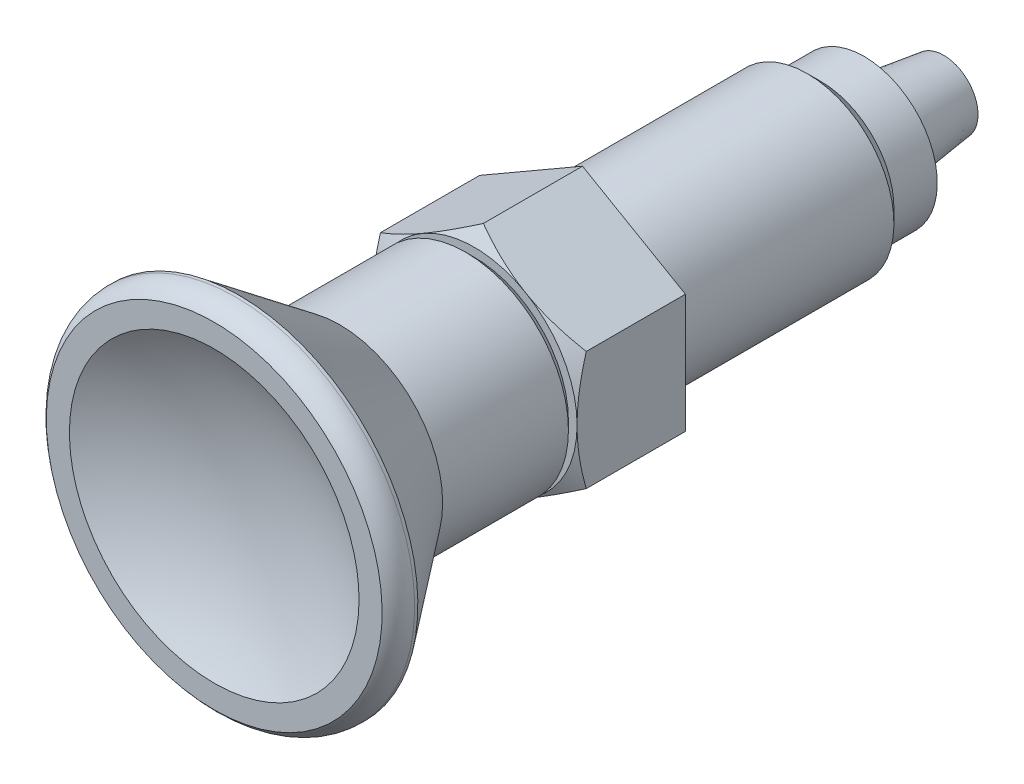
ISO-10303-21;
HEADER;
FILE_DESCRIPTION(('STEP AP214'),'2;1');
FILE_NAME('part.step','',(''),(''),'','','');
FILE_SCHEMA(('AUTOMOTIVE_DESIGN { 1 0 10303 214 1 1 1 1 }'));
ENDSEC;
DATA;
#1=APPLICATION_CONTEXT('core data for automotive mechanical design processes');
#2=APPLICATION_PROTOCOL_DEFINITION('international standard','automotive_design',2000,#1);
#3=PRODUCT_CONTEXT('',#1,'mechanical');
#4=PRODUCT('Part','Part','',(#3));
#5=PRODUCT_RELATED_PRODUCT_CATEGORY('part','',(#4));
#6=PRODUCT_DEFINITION_FORMATION('','',#4);
#7=PRODUCT_DEFINITION_CONTEXT('part definition',#1,'design');
#8=PRODUCT_DEFINITION('design','',#6,#7);
#9=PRODUCT_DEFINITION_SHAPE('','',#8);
#10=(LENGTH_UNIT() NAMED_UNIT(*) SI_UNIT(.MILLI.,.METRE.));
#11=(NAMED_UNIT(*) PLANE_ANGLE_UNIT() SI_UNIT($,.RADIAN.));
#12=(NAMED_UNIT(*) SI_UNIT($,.STERADIAN.) SOLID_ANGLE_UNIT());
#13=UNCERTAINTY_MEASURE_WITH_UNIT(LENGTH_MEASURE(1.E-05),#10,'distance_accuracy_value','');
#14=(GEOMETRIC_REPRESENTATION_CONTEXT(3) GLOBAL_UNCERTAINTY_ASSIGNED_CONTEXT((#13)) GLOBAL_UNIT_ASSIGNED_CONTEXT((#10,
#11,#12)) REPRESENTATION_CONTEXT('',''));
#15=CARTESIAN_POINT('',(0.,0.,0.));
#16=DIRECTION('',(0.,0.,1.));
#17=DIRECTION('',(1.,0.,0.));
#18=AXIS2_PLACEMENT_3D('',#15,#16,#17);
#19=CARTESIAN_POINT('',(0.,0.,-26.));
#20=DIRECTION('',(1.,0.,0.));
#21=DIRECTION('',(0.,-1.,0.));
#22=AXIS2_PLACEMENT_3D('',#19,#20,#21);
#23=SPHERICAL_SURFACE('',#22,8.);
#24=CARTESIAN_POINT('',(0.,0.,-33.3475882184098));
#25=DIRECTION('',(0.,0.,1.));
#26=DIRECTION('',(0.,1.,0.));
#27=AXIS2_PLACEMENT_3D('',#24,#25,#26);
#28=CIRCLE('',#27,3.16432415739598);
#29=CARTESIAN_POINT('',(0.,3.16432415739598,-33.3475882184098));
#30=VERTEX_POINT('',#29);
#31=EDGE_CURVE('E18',#30,#30,#28,.T.);
#32=ORIENTED_EDGE('',*,*,#31,.F.);
#33=EDGE_LOOP('',(#32));
#34=FACE_BOUND('',#33,.T.);
#35=ADVANCED_FACE('F14',(#34),#23,.T.);
#36=CARTESIAN_POINT('',(0.,0.,-26.9999999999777));
#37=DIRECTION('',(0.,0.,1.));
#38=DIRECTION('',(0.,1.,0.));
#39=AXIS2_PLACEMENT_3D('',#36,#37,#38);
#40=CONICAL_SURFACE('',#39,4.00000000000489,0.130899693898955);
#41=CARTESIAN_POINT('',(0.,0.,-27.));
#42=DIRECTION('',(0.,0.,1.));
#43=DIRECTION('',(0.,1.,0.));
#44=AXIS2_PLACEMENT_3D('',#41,#42,#43);
#45=CIRCLE('',#44,4.);
#46=CARTESIAN_POINT('',(0.,4.,-27.));
#47=VERTEX_POINT('',#46);
#48=EDGE_CURVE('E287',#47,#47,#45,.T.);
#49=ORIENTED_EDGE('',*,*,#48,.F.);
#50=EDGE_LOOP('',(#49));
#51=FACE_BOUND('',#50,.T.);
#52=ORIENTED_EDGE('',*,*,#31,.T.);
#53=EDGE_LOOP('',(#52));
#54=FACE_BOUND('',#53,.T.);
#55=ADVANCED_FACE('F614',(#51,#54),#40,.T.);
#56=CARTESIAN_POINT('',(0.,0.,-34.));
#57=DIRECTION('',(0.,0.,1.));
#58=DIRECTION('',(0.,1.,0.));
#59=AXIS2_PLACEMENT_3D('',#56,#57,#58);
#60=CYLINDRICAL_SURFACE('',#59,4.);
#61=CARTESIAN_POINT('',(0.,0.,-26.3732050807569));
#62=DIRECTION('',(0.,0.,-1.));
#63=DIRECTION('',(0.,-1.,0.));
#64=AXIS2_PLACEMENT_3D('',#61,#62,#63);
#65=CIRCLE('',#64,4.);
#66=CARTESIAN_POINT('',(0.,-4.,-26.3732050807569));
#67=VERTEX_POINT('',#66);
#68=EDGE_CURVE('E283',#67,#67,#65,.T.);
#69=ORIENTED_EDGE('',*,*,#68,.T.);
#70=EDGE_LOOP('',(#69));
#71=FACE_BOUND('',#70,.T.);
#72=ORIENTED_EDGE('',*,*,#48,.T.);
#73=EDGE_LOOP('',(#72));
#74=FACE_BOUND('',#73,.T.);
#75=ADVANCED_FACE('F606',(#71,#74),#60,.T.);
#76=CARTESIAN_POINT('',(0.,0.,-26.2));
#77=DIRECTION('',(0.,0.,-1.));
#78=DIRECTION('',(0.,-1.,0.));
#79=AXIS2_PLACEMENT_3D('',#76,#77,#78);
#80=TOROIDAL_SURFACE('',#79,4.1,0.2);
#81=CARTESIAN_POINT('',(0.,0.,-26.));
#82=DIRECTION('',(0.,0.,-1.));
#83=DIRECTION('',(0.,-1.,0.));
#84=AXIS2_PLACEMENT_3D('',#81,#82,#83);
#85=CIRCLE('',#84,4.1);
#86=CARTESIAN_POINT('',(0.,-4.1,-26.));
#87=VERTEX_POINT('',#86);
#88=EDGE_CURVE('E286',#87,#87,#85,.T.);
#89=ORIENTED_EDGE('',*,*,#88,.T.);
#90=EDGE_LOOP('',(#89));
#91=FACE_BOUND('',#90,.T.);
#92=ORIENTED_EDGE('',*,*,#68,.F.);
#93=EDGE_LOOP('',(#92));
#94=FACE_BOUND('',#93,.T.);
#95=ADVANCED_FACE('F265',(#91,#94),#80,.F.);
#96=CARTESIAN_POINT('',(-5.2,0.,-26.));
#97=DIRECTION('',(0.,0.,1.));
#98=DIRECTION('',(0.,1.,0.));
#99=AXIS2_PLACEMENT_3D('',#96,#97,#98);
#100=PLANE('',#99);
#101=CARTESIAN_POINT('',(0.,0.,-26.0000000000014));
#102=DIRECTION('',(0.,0.,1.));
#103=DIRECTION('',(0.,1.,0.));
#104=AXIS2_PLACEMENT_3D('',#101,#102,#103);
#105=CIRCLE('',#104,5.19999999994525);
#106=CARTESIAN_POINT('',(0.,5.19999999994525,-26.0000000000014));
#107=VERTEX_POINT('',#106);
#108=EDGE_CURVE('E414',#107,#107,#105,.T.);
#109=ORIENTED_EDGE('',*,*,#108,.F.);
#110=EDGE_LOOP('',(#109));
#111=FACE_BOUND('',#110,.T.);
#112=ORIENTED_EDGE('',*,*,#88,.F.);
#113=EDGE_LOOP('',(#112));
#114=FACE_BOUND('',#113,.T.);
#115=ADVANCED_FACE('F260',(#111,#114),#100,.F.);
#116=CARTESIAN_POINT('',(0.,0.,-25.7000000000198));
#117=DIRECTION('',(0.,0.,1.));
#118=DIRECTION('',(0.,1.,0.));
#119=AXIS2_PLACEMENT_3D('',#116,#117,#118);
#120=CONICAL_SURFACE('',#119,5.49999999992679,0.785398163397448);
#121=CARTESIAN_POINT('',(0.,0.,-25.7));
#122=DIRECTION('',(0.,0.,1.));
#123=DIRECTION('',(0.,1.,0.));
#124=AXIS2_PLACEMENT_3D('',#121,#122,#123);
#125=CIRCLE('',#124,5.5);
#126=CARTESIAN_POINT('',(0.,5.5,-25.7));
#127=VERTEX_POINT('',#126);
#128=EDGE_CURVE('E411',#127,#127,#125,.F.);
#129=ORIENTED_EDGE('',*,*,#128,.T.);
#130=EDGE_LOOP('',(#129));
#131=FACE_BOUND('',#130,.T.);
#132=ORIENTED_EDGE('',*,*,#108,.T.);
#133=EDGE_LOOP('',(#132));
#134=FACE_BOUND('',#133,.T.);
#135=ADVANCED_FACE('F256',(#131,#134),#120,.T.);
#136=CARTESIAN_POINT('',(0.,0.,-26.));
#137=DIRECTION('',(0.,0.,1.));
#138=DIRECTION('',(0.,1.,0.));
#139=AXIS2_PLACEMENT_3D('',#136,#137,#138);
#140=CYLINDRICAL_SURFACE('',#139,5.5);
#141=ORIENTED_EDGE('',*,*,#128,.F.);
#142=EDGE_LOOP('',(#141));
#143=FACE_BOUND('',#142,.T.);
#144=CARTESIAN_POINT('',(0.,0.,-26.));
#145=DIRECTION('',(0.,0.,1.));
#146=DIRECTION('',(0.,1.,0.));
#147=AXIS2_PLACEMENT_3D('',#144,#145,#146);
#148=CIRCLE('',#147,5.5);
#149=CARTESIAN_POINT('',(0.,5.5,-26.));
#150=VERTEX_POINT('',#149);
#151=EDGE_CURVE('E413',#150,#150,#148,.T.);
#152=ORIENTED_EDGE('',*,*,#151,.F.);
#153=EDGE_LOOP('',(#152));
#154=FACE_BOUND('',#153,.T.);
#155=ADVANCED_FACE('F252',(#143,#154),#140,.F.);
#156=CARTESIAN_POINT('',(-5.5,0.,-26.));
#157=DIRECTION('',(0.,0.,-1.));
#158=DIRECTION('',(0.,-1.,0.));
#159=AXIS2_PLACEMENT_3D('',#156,#157,#158);
#160=PLANE('',#159);
#161=ORIENTED_EDGE('',*,*,#151,.T.);
#162=EDGE_LOOP('',(#161));
#163=FACE_BOUND('',#162,.T.);
#164=CARTESIAN_POINT('',(0.,0.,-26.));
#165=DIRECTION('',(0.,0.,1.));
#166=DIRECTION('',(0.,1.,0.));
#167=AXIS2_PLACEMENT_3D('',#164,#165,#166);
#168=CIRCLE('',#167,6.75);
#169=CARTESIAN_POINT('',(0.,6.75,-26.));
#170=VERTEX_POINT('',#169);
#171=EDGE_CURVE('E408',#170,#170,#168,.T.);
#172=ORIENTED_EDGE('',*,*,#171,.F.);
#173=EDGE_LOOP('',(#172));
#174=FACE_BOUND('',#173,.T.);
#175=ADVANCED_FACE('F243',(#163,#174),#160,.T.);
#176=CARTESIAN_POINT('',(0.,0.,-26.));
#177=DIRECTION('',(0.,0.,1.));
#178=DIRECTION('',(0.,1.,0.));
#179=AXIS2_PLACEMENT_3D('',#176,#177,#178);
#180=CYLINDRICAL_SURFACE('',#179,6.75);
#181=ORIENTED_EDGE('',*,*,#171,.T.);
#182=EDGE_LOOP('',(#181));
#183=FACE_BOUND('',#182,.T.);
#184=CARTESIAN_POINT('',(0.,0.,-21.9999999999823));
#185=DIRECTION('',(0.,0.,1.));
#186=DIRECTION('',(0.,1.,0.));
#187=AXIS2_PLACEMENT_3D('',#184,#185,#186);
#188=CIRCLE('',#187,6.74999999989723);
#189=CARTESIAN_POINT('',(0.,6.74999999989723,-21.9999999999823));
#190=VERTEX_POINT('',#189);
#191=EDGE_CURVE('E404',#190,#190,#188,.T.);
#192=ORIENTED_EDGE('',*,*,#191,.F.);
#193=EDGE_LOOP('',(#192));
#194=FACE_BOUND('',#193,.T.);
#195=ADVANCED_FACE('F233',(#183,#194),#180,.T.);
#196=CARTESIAN_POINT('',(0.,0.,-20.7500000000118));
#197=DIRECTION('',(0.,0.,1.));
#198=DIRECTION('',(1.,0.,0.));
#199=AXIS2_PLACEMENT_3D('',#196,#197,#198);
#200=CONICAL_SURFACE('',#199,7.99999999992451,0.785398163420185);
#201=ORIENTED_EDGE('',*,*,#191,.T.);
#202=EDGE_LOOP('',(#201));
#203=FACE_BOUND('',#202,.T.);
#204=CARTESIAN_POINT('',(0.,0.,-20.75));
#205=DIRECTION('',(0.,0.,1.));
#206=DIRECTION('',(0.,1.,0.));
#207=AXIS2_PLACEMENT_3D('',#204,#205,#206);
#208=CIRCLE('',#207,8.);
#209=CARTESIAN_POINT('',(0.,8.,-20.75));
#210=VERTEX_POINT('',#209);
#211=EDGE_CURVE('E401',#210,#210,#208,.T.);
#212=ORIENTED_EDGE('',*,*,#211,.F.);
#213=EDGE_LOOP('',(#212));
#214=FACE_BOUND('',#213,.T.);
#215=ADVANCED_FACE('F230',(#203,#214),#200,.T.);
#216=CARTESIAN_POINT('',(0.,0.,56.3));
#217=DIRECTION('',(1.,0.,0.));
#218=DIRECTION('',(0.,-1.,0.));
#219=AXIS2_PLACEMENT_3D('',#216,#217,#218);
#220=SPHERICAL_SURFACE('',#219,26.);
#221=CARTESIAN_POINT('',(0.,-13.3682459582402,34.));
#222=CARTESIAN_POINT('',(0.375585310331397,-13.3682486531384,34.));
#223=CARTESIAN_POINT('',(0.751126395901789,-13.3524111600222,34.));
#224=CARTESIAN_POINT('',(1.49966463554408,-13.2891717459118,34.));
#225=CARTESIAN_POINT('',(1.87266109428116,-13.2417615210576,34.));
#226=CARTESIAN_POINT('',(2.61372997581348,-13.1156339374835,34.));
#227=CARTESIAN_POINT('',(2.98179666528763,-13.0368829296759,34.));
#228=CARTESIAN_POINT('',(3.70998226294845,-12.848636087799,34.));
#229=CARTESIAN_POINT('',(4.07010119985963,-12.7391403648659,34.));
#230=CARTESIAN_POINT('',(4.77965529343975,-12.4902434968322,34.));
#231=CARTESIAN_POINT('',(5.12909553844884,-12.3508568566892,34.));
#232=CARTESIAN_POINT('',(5.81499557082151,-12.0431356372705,34.));
#233=CARTESIAN_POINT('',(6.15145515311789,-11.8748006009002,34.));
#234=CARTESIAN_POINT('',(6.80891126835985,-11.5104276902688,34.));
#235=CARTESIAN_POINT('',(7.12991172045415,-11.314396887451,34.));
#236=CARTESIAN_POINT('',(7.75425858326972,-10.8959942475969,34.));
#237=CARTESIAN_POINT('',(8.05760506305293,-10.673622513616,34.));
#238=CARTESIAN_POINT('',(8.64452045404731,-10.2040929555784,34.));
#239=CARTESIAN_POINT('',(8.92808725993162,-9.95693249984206,34.));
#240=CARTESIAN_POINT('',(9.47339223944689,-9.43960204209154,34.));
#241=CARTESIAN_POINT('',(9.7351303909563,-9.16943201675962,34.));
#242=CARTESIAN_POINT('',(10.2349267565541,-8.60799236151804,34.));
#243=CARTESIAN_POINT('',(10.472984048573,-8.31672191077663,34.));
#244=CARTESIAN_POINT('',(10.9237145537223,-7.7151616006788,34.));
#245=CARTESIAN_POINT('',(11.1363877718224,-7.40487174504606,34.));
#246=CARTESIAN_POINT('',(11.5348344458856,-6.76748455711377,34.));
#247=CARTESIAN_POINT('',(11.7206084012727,-6.44038753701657,34.));
#248=CARTESIAN_POINT('',(12.063940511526,-5.77170618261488,34.));
#249=CARTESIAN_POINT('',(12.2214986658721,-5.43012184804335,34.));
#250=CARTESIAN_POINT('',(12.5072787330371,-4.73489504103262,34.));
#251=CARTESIAN_POINT('',(12.6355007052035,-4.38125259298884,34.));
#252=CARTESIAN_POINT('',(12.8616972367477,-3.66442308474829,34.));
#253=CARTESIAN_POINT('',(12.9596717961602,-3.30123602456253,34.));
#254=CARTESIAN_POINT('',(13.1246771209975,-2.56789862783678,34.));
#255=CARTESIAN_POINT('',(13.1917078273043,-2.19774827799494,34.));
#256=CARTESIAN_POINT('',(13.2943486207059,-1.45311652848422,34.));
#257=CARTESIAN_POINT('',(13.3299587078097,-1.07863512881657,34.));
#258=CARTESIAN_POINT('',(13.3695050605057,-0.328004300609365,34.));
#259=CARTESIAN_POINT('',(13.373441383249,0.0481451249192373,34.));
#260=CARTESIAN_POINT('',(13.3496123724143,0.799438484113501,34.));
#261=CARTESIAN_POINT('',(13.3218470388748,1.17458241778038,34.));
#262=CARTESIAN_POINT('',(13.2348120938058,1.92119788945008,34.));
#263=CARTESIAN_POINT('',(13.1755424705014,2.29266942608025,34.));
#264=CARTESIAN_POINT('',(13.0259203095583,3.02929902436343,34.));
#265=CARTESIAN_POINT('',(12.9355677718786,3.39445708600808,34.));
#266=CARTESIAN_POINT('',(12.7244220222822,4.11586406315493,34.));
#267=CARTESIAN_POINT('',(12.6036287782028,4.47211296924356,34.));
#268=CARTESIAN_POINT('',(12.3324604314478,5.17316851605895,34.));
#269=CARTESIAN_POINT('',(12.182085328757,5.51797515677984,34.));
#270=CARTESIAN_POINT('',(11.8528223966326,6.19369469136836,34.));
#271=CARTESIAN_POINT('',(11.6739345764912,6.5246075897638,34.));
#272=CARTESIAN_POINT('',(11.2889179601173,7.17018716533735,34.));
#273=CARTESIAN_POINT('',(11.0827891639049,7.48485384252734,34.));
#274=CARTESIAN_POINT('',(10.644756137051,8.09570375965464,34.));
#275=CARTESIAN_POINT('',(10.4128519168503,8.39188700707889,34.));
#276=CARTESIAN_POINT('',(9.92491667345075,8.96366451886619,34.));
#277=CARTESIAN_POINT('',(9.66888565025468,9.23925878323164,34.));
#278=CARTESIAN_POINT('',(9.13451699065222,9.76789905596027,34.));
#279=CARTESIAN_POINT('',(8.85617935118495,10.0209450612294,34.));
#280=CARTESIAN_POINT('',(8.2791763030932,10.5026897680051,34.));
#281=CARTESIAN_POINT('',(7.98051089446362,10.7313884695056,34.));
#282=CARTESIAN_POINT('',(7.36497559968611,11.1628126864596,34.));
#283=CARTESIAN_POINT('',(7.04810571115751,11.3655381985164,34.));
#284=CARTESIAN_POINT('',(6.39841424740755,11.7435747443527,34.));
#285=CARTESIAN_POINT('',(6.06559267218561,11.9188857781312,34.));
#286=CARTESIAN_POINT('',(5.38636401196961,12.2408470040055,34.));
#287=CARTESIAN_POINT('',(5.03995692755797,12.3874971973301,34.));
#288=CARTESIAN_POINT('',(4.33601998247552,12.6510941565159,34.));
#289=CARTESIAN_POINT('',(3.9784901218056,12.7680409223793,34.));
#290=CARTESIAN_POINT('',(3.25484946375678,12.9713996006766,34.));
#291=CARTESIAN_POINT('',(2.8887386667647,13.0578115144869,34.));
#292=CARTESIAN_POINT('',(2.15053894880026,13.1994861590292,34.));
#293=CARTESIAN_POINT('',(1.77845002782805,13.2547488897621,34.));
#294=CARTESIAN_POINT('',(1.03093939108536,13.3337322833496,34.));
#295=CARTESIAN_POINT('',(0.655517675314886,13.3574529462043,34.));
#296=CARTESIAN_POINT('',(-0.09598952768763,13.3731835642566,34.));
#297=CARTESIAN_POINT('',(-0.472075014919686,13.3651935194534,34.));
#298=CARTESIAN_POINT('',(-1.22223603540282,13.3175595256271,34.));
#299=CARTESIAN_POINT('',(-1.5963115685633,13.277915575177,34.));
#300=CARTESIAN_POINT('',(-2.33979321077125,13.1672556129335,34.));
#301=CARTESIAN_POINT('',(-2.70919931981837,13.0962396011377,34.));
#302=CARTESIAN_POINT('',(-3.44071587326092,12.9233403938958,34.));
#303=CARTESIAN_POINT('',(-3.80282631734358,12.8214571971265,34.));
#304=CARTESIAN_POINT('',(-4.51717713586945,12.5875479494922,34.));
#305=CARTESIAN_POINT('',(-4.86941751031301,12.4555218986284,34.));
#306=CARTESIAN_POINT('',(-5.56152392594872,12.1622655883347,34.));
#307=CARTESIAN_POINT('',(-5.90138996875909,12.001035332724,34.));
#308=CARTESIAN_POINT('',(-6.56633152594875,11.6505168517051,34.));
#309=CARTESIAN_POINT('',(-6.89140704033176,11.461228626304,34.));
#310=CARTESIAN_POINT('',(-7.52445640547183,11.0559399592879,34.));
#311=CARTESIAN_POINT('',(-7.83243025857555,10.8399395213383,34.));
#312=CARTESIAN_POINT('',(-8.42908684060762,10.3827620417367,34.));
#313=CARTESIAN_POINT('',(-8.71776956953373,10.1415850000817,34.));
#314=CARTESIAN_POINT('',(-9.27379165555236,9.63576883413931,34.));
#315=CARTESIAN_POINT('',(-9.54113100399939,9.37112970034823,34.));
#316=CARTESIAN_POINT('',(-10.0525655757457,8.82027085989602,34.));
#317=CARTESIAN_POINT('',(-10.296660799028,8.53405115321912,34.));
#318=CARTESIAN_POINT('',(-10.7598718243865,7.9420659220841,34.));
#319=CARTESIAN_POINT('',(-10.9789876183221,7.63630039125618,34.));
#320=CARTESIAN_POINT('',(-11.3906819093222,7.0073974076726,34.));
#321=CARTESIAN_POINT('',(-11.5832604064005,6.68425995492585,34.));
#322=CARTESIAN_POINT('',(-11.9405107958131,6.02291079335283,34.));
#323=CARTESIAN_POINT('',(-12.1051827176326,5.68469910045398,34.));
#324=CARTESIAN_POINT('',(-12.405449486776,4.9956056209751,34.));
#325=CARTESIAN_POINT('',(-12.5410443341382,4.64472383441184,34.));
#326=CARTESIAN_POINT('',(-12.782192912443,3.93278485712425,34.));
#327=CARTESIAN_POINT('',(-12.8877466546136,3.5717276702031,34.));
#328=CARTESIAN_POINT('',(-13.0680626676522,2.84200466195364,34.));
#329=CARTESIAN_POINT('',(-13.1428249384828,2.4733388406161,34.));
#330=CARTESIAN_POINT('',(-13.2610266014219,1.73101888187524,34.));
#331=CARTESIAN_POINT('',(-13.3044659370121,1.35736473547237,34.));
#332=CARTESIAN_POINT('',(-13.3597126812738,0.607725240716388,34.));
#333=CARTESIAN_POINT('',(-13.3715200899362,0.231739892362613,34.));
#334=CARTESIAN_POINT('',(-13.3634190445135,-0.519888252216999,34.));
#335=CARTESIAN_POINT('',(-13.3435106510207,-0.895531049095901,34.));
#336=CARTESIAN_POINT('',(-13.2721196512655,-1.64380422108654,34.));
#337=CARTESIAN_POINT('',(-13.2206370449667,-2.01643459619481,34.));
#338=CARTESIAN_POINT('',(-13.0864634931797,-2.75603450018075,34.));
#339=CARTESIAN_POINT('',(-13.0037724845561,-3.12300401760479,34.));
#340=CARTESIAN_POINT('',(-12.8077700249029,-3.84867248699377,34.));
#341=CARTESIAN_POINT('',(-12.6944585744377,-4.20737143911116,34.));
#342=CARTESIAN_POINT('',(-12.4380184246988,-4.91395521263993,34.));
#343=CARTESIAN_POINT('',(-12.2948891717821,-5.261839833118,34.));
#344=CARTESIAN_POINT('',(-11.9798322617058,-5.94431469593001,34.));
#345=CARTESIAN_POINT('',(-11.8079045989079,-6.27890493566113,34.));
#346=CARTESIAN_POINT('',(-11.4364804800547,-6.93239940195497,34.));
#347=CARTESIAN_POINT('',(-11.2369850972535,-7.25130423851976,34.));
#348=CARTESIAN_POINT('',(-10.8118388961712,-7.87117441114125,34.));
#349=CARTESIAN_POINT('',(-10.5861881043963,-8.17213976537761,34.));
#350=CARTESIAN_POINT('',(-10.110360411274,-8.75396077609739,34.));
#351=CARTESIAN_POINT('',(-9.86018611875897,-9.03481856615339,34.));
#352=CARTESIAN_POINT('',(-9.33706848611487,-9.57446448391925,34.));
#353=CARTESIAN_POINT('',(-9.06412505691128,-9.83325252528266,34.));
#354=CARTESIAN_POINT('',(-8.49733759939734,-10.3269813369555,34.));
#355=CARTESIAN_POINT('',(-8.20348826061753,-10.5619160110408,34.));
#356=CARTESIAN_POINT('',(-7.59704532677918,-11.0061886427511,34.));
#357=CARTESIAN_POINT('',(-7.28445202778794,-11.2155270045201,34.));
#358=CARTESIAN_POINT('',(-6.64258363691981,-11.6072177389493,34.));
#359=CARTESIAN_POINT('',(-6.31330053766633,-11.7895569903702,34.));
#360=CARTESIAN_POINT('',(-5.64053678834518,-12.1258308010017,34.));
#361=CARTESIAN_POINT('',(-5.2970560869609,-12.2797652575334,34.));
#362=CARTESIAN_POINT('',(-4.59871120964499,-12.5579840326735,34.));
#363=CARTESIAN_POINT('',(-4.24385967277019,-12.682300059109,34.));
#364=CARTESIAN_POINT('',(-3.52506734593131,-12.9005804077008,34.));
#365=CARTESIAN_POINT('',(-3.16112897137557,-12.99455270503,34.));
#366=CARTESIAN_POINT('',(-2.33514245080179,-13.1710678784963,34.));
#367=CARTESIAN_POINT('',(-1.87121744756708,-13.2449469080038,34.));
#368=CARTESIAN_POINT('',(-0.938171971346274,-13.3435342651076,34.));
#369=CARTESIAN_POINT('',(-0.46905149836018,-13.3682425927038,34.));
#370=CARTESIAN_POINT('',(0.,-13.3682459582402,34.));
#371=B_SPLINE_CURVE_WITH_KNOTS('',3,(#221,#222,#223,#224,#225,#226,#227,#228,#229,#230,#231,
#232,#233,#234,#235,#236,#237,#238,#239,#240,#241,#242,#243,#244,#245,#246,#247,#248,#249,#250,
#251,#252,#253,#254,#255,#256,#257,#258,#259,#260,#261,#262,#263,#264,#265,#266,#267,#268,#269,
#270,#271,#272,#273,#274,#275,#276,#277,#278,#279,#280,#281,#282,#283,#284,#285,#286,#287,#288,
#289,#290,#291,#292,#293,#294,#295,#296,#297,#298,#299,#300,#301,#302,#303,#304,#305,#306,#307,
#308,#309,#310,#311,#312,#313,#314,#315,#316,#317,#318,#319,#320,#321,#322,#323,#324,#325,#326,
#327,#328,#329,#330,#331,#332,#333,#334,#335,#336,#337,#338,#339,#340,#341,#342,#343,#344,#345,
#346,#347,#348,#349,#350,#351,#352,#353,#354,#355,#356,#357,#358,#359,#360,#361,#362,#363,#364,
#365,#366,#367,#368,#369,#370),.UNSPECIFIED.,.T.,.F.,(4,2,2,2,2,2,2,2,2,2,2,2,2,2,2,2,2,2,2,2,2,
2,2,2,2,2,2,2,2,2,2,2,2,2,2,2,2,2,2,2,2,2,2,2,2,2,2,2,2,2,2,2,2,2,2,2,2,2,2,2,2,2,2,2,2,2,2,2,2,
2,2,2,2,2,4),(0.,1.12634621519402,2.25298878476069,3.38084425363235,4.50869564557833,
5.63600096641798,6.76332408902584,7.89035989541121,9.01739129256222,10.1445424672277,
11.2716947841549,12.3988909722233,13.5260869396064,14.6532619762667,15.7804370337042,
16.907609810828,18.0347825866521,19.1619575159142,20.2891324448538,21.4163053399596,
22.5434782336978,23.6706515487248,24.7978248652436,25.9249993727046,27.0521738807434,
28.1793480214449,29.3065221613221,30.4336958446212,31.5608695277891,32.6880433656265,
33.8152172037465,34.9423911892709,36.0695651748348,37.1967391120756,38.3239130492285,
39.4510869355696,40.5782608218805,41.7054347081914,42.8326085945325,43.9597825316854,
45.0869564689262,46.2141304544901,47.3413044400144,48.4684782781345,49.5956521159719,
50.7228257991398,51.8499994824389,52.9771736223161,54.1043477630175,55.2315222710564,
56.3586967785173,57.4858700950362,58.6130434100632,59.7402163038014,60.8673891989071,
61.9945641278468,63.1217390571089,64.248911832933,65.3760846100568,66.5032596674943,
67.6304347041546,68.7576306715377,69.8848268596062,71.0119791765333,72.1391303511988,
73.2661617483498,74.3931975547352,75.520520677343,76.6478259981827,77.7756773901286,
78.9035328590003,80.030175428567,81.156521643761,82.5631644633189,83.9698072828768),.UNSPECIFIED.);
#372=CARTESIAN_POINT('',(0.,-13.3682459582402,34.));
#373=VERTEX_POINT('',#372);
#374=EDGE_CURVE('E313',#373,#373,#371,.T.);
#375=ORIENTED_EDGE('',*,*,#374,.T.);
#376=EDGE_LOOP('',(#375));
#377=FACE_BOUND('',#376,.T.);
#378=ADVANCED_FACE('F232',(#377),#220,.F.);
#379=CARTESIAN_POINT('',(-13.36824595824,0.,34.));
#380=DIRECTION('',(0.,0.,-1.));
#381=DIRECTION('',(0.,-1.,0.));
#382=AXIS2_PLACEMENT_3D('',#379,#380,#381);
#383=PLANE('',#382);
#384=ORIENTED_EDGE('',*,*,#374,.F.);
#385=EDGE_LOOP('',(#384));
#386=FACE_BOUND('',#385,.T.);
#387=CARTESIAN_POINT('',(0.,0.,34.));
#388=DIRECTION('',(0.,0.,-1.));
#389=DIRECTION('',(0.,-1.,0.));
#390=AXIS2_PLACEMENT_3D('',#387,#388,#389);
#391=CIRCLE('',#390,15.5);
#392=CARTESIAN_POINT('',(0.,-15.5,34.));
#393=VERTEX_POINT('',#392);
#394=EDGE_CURVE('E306',#393,#393,#391,.T.);
#395=ORIENTED_EDGE('',*,*,#394,.F.);
#396=EDGE_LOOP('',(#395));
#397=FACE_BOUND('',#396,.T.);
#398=ADVANCED_FACE('F241',(#386,#397),#383,.F.);
#399=CARTESIAN_POINT('',(0.,0.,32.));
#400=DIRECTION('',(0.,0.,-1.));
#401=DIRECTION('',(0.,-1.,0.));
#402=AXIS2_PLACEMENT_3D('',#399,#400,#401);
#403=TOROIDAL_SURFACE('',#402,14.,2.5);
#404=CARTESIAN_POINT('',(0.,0.,32.));
#405=DIRECTION('',(0.,0.,1.));
#406=DIRECTION('',(0.,1.,0.));
#407=AXIS2_PLACEMENT_3D('',#404,#405,#406);
#408=CIRCLE('',#407,16.5);
#409=CARTESIAN_POINT('',(0.,16.5,32.));
#410=VERTEX_POINT('',#409);
#411=EDGE_CURVE('E664',#410,#410,#408,.F.);
#412=ORIENTED_EDGE('',*,*,#411,.F.);
#413=EDGE_LOOP('',(#412));
#414=FACE_BOUND('',#413,.T.);
#415=ORIENTED_EDGE('',*,*,#394,.T.);
#416=EDGE_LOOP('',(#415));
#417=FACE_BOUND('',#416,.T.);
#418=ADVANCED_FACE('F327',(#414,#417),#403,.T.);
#419=CARTESIAN_POINT('',(0.,0.,-34.));
#420=DIRECTION('',(0.,0.,1.));
#421=DIRECTION('',(0.,1.,0.));
#422=AXIS2_PLACEMENT_3D('',#419,#420,#421);
#423=CYLINDRICAL_SURFACE('',#422,16.5);
#424=ORIENTED_EDGE('',*,*,#411,.T.);
#425=EDGE_LOOP('',(#424));
#426=FACE_BOUND('',#425,.T.);
#427=CARTESIAN_POINT('',(0.,0.,31.7));
#428=DIRECTION('',(0.,0.,1.));
#429=DIRECTION('',(0.,1.,0.));
#430=AXIS2_PLACEMENT_3D('',#427,#428,#429);
#431=CIRCLE('',#430,16.5);
#432=CARTESIAN_POINT('',(0.,16.5,31.7));
#433=VERTEX_POINT('',#432);
#434=EDGE_CURVE('E9',#433,#433,#431,.F.);
#435=ORIENTED_EDGE('',*,*,#434,.F.);
#436=EDGE_LOOP('',(#435));
#437=FACE_BOUND('',#436,.T.);
#438=ADVANCED_FACE('F538',(#426,#437),#423,.T.);
#439=CARTESIAN_POINT('',(0.,0.,31.7));
#440=DIRECTION('',(0.,0.,1.));
#441=DIRECTION('',(1.,0.,0.));
#442=AXIS2_PLACEMENT_3D('',#439,#440,#441);
#443=CONICAL_SURFACE('',#442,16.5,0.645771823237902);
#444=ORIENTED_EDGE('',*,*,#434,.T.);
#445=EDGE_LOOP('',(#444));
#446=FACE_BOUND('',#445,.T.);
#447=CARTESIAN_POINT('',(0.,0.,22.4106862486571));
#448=DIRECTION('',(0.,0.,1.));
#449=DIRECTION('',(0.,1.,0.));
#450=AXIS2_PLACEMENT_3D('',#447,#448,#449);
#451=CIRCLE('',#450,9.5);
#452=CARTESIAN_POINT('',(0.,9.5,22.4106862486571));
#453=VERTEX_POINT('',#452);
#454=EDGE_CURVE('E24',#453,#453,#451,.T.);
#455=ORIENTED_EDGE('',*,*,#454,.T.);
#456=EDGE_LOOP('',(#455));
#457=FACE_BOUND('',#456,.T.);
#458=ADVANCED_FACE('F526',(#446,#457),#443,.T.);
#459=CARTESIAN_POINT('',(0.,0.,-34.));
#460=DIRECTION('',(0.,0.,1.));
#461=DIRECTION('',(0.,1.,0.));
#462=AXIS2_PLACEMENT_3D('',#459,#460,#461);
#463=CYLINDRICAL_SURFACE('',#462,9.5);
#464=ORIENTED_EDGE('',*,*,#454,.F.);
#465=EDGE_LOOP('',(#464));
#466=FACE_BOUND('',#465,.T.);
#467=CARTESIAN_POINT('',(0.,0.,10.8));
#468=DIRECTION('',(0.,0.,1.));
#469=DIRECTION('',(0.,1.,0.));
#470=AXIS2_PLACEMENT_3D('',#467,#468,#469);
#471=CIRCLE('',#470,9.5);
#472=CARTESIAN_POINT('',(0.,9.5,10.8));
#473=VERTEX_POINT('',#472);
#474=EDGE_CURVE('E309',#473,#473,#471,.T.);
#475=ORIENTED_EDGE('',*,*,#474,.T.);
#476=EDGE_LOOP('',(#475));
#477=FACE_BOUND('',#476,.T.);
#478=ADVANCED_FACE('F337',(#466,#477),#463,.T.);
#479=CARTESIAN_POINT('',(0.,0.,10.8));
#480=DIRECTION('',(0.,0.,1.));
#481=DIRECTION('',(1.,0.,0.));
#482=AXIS2_PLACEMENT_3D('',#479,#480,#481);
#483=CONICAL_SURFACE('',#482,9.5,0.785398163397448);
#484=ORIENTED_EDGE('',*,*,#474,.F.);
#485=EDGE_LOOP('',(#484));
#486=FACE_BOUND('',#485,.T.);
#487=CARTESIAN_POINT('',(0.,0.,10.));
#488=DIRECTION('',(0.,0.,1.));
#489=DIRECTION('',(1.,0.,0.));
#490=AXIS2_PLACEMENT_3D('',#487,#488,#489);
#491=CIRCLE('',#490,8.7);
#492=CARTESIAN_POINT('',(8.7,0.,10.));
#493=VERTEX_POINT('',#492);
#494=EDGE_CURVE('E310',#493,#493,#491,.T.);
#495=ORIENTED_EDGE('',*,*,#494,.T.);
#496=EDGE_LOOP('',(#495));
#497=FACE_BOUND('',#496,.T.);
#498=ADVANCED_FACE('F329',(#486,#497),#483,.T.);
#499=CARTESIAN_POINT('',(-9.5,0.,10.));
#500=DIRECTION('',(0.,0.,1.));
#501=DIRECTION('',(0.,1.,0.));
#502=AXIS2_PLACEMENT_3D('',#499,#500,#501);
#503=PLANE('',#502);
#504=CARTESIAN_POINT('',(0.,0.,10.));
#505=DIRECTION('',(0.,0.,-1.));
#506=DIRECTION('',(0.,-1.,0.));
#507=AXIS2_PLACEMENT_3D('',#504,#505,#506);
#508=CIRCLE('',#507,9.5);
#509=CARTESIAN_POINT('',(9.5,0.,10.));
#510=VERTEX_POINT('',#509);
#511=CARTESIAN_POINT('',(4.75,8.22724133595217,10.));
#512=VERTEX_POINT('',#511);
#513=EDGE_CURVE('E342',#510,#512,#508,.F.);
#514=ORIENTED_EDGE('',*,*,#513,.T.);
#515=CARTESIAN_POINT('',(0.,0.,10.));
#516=DIRECTION('',(0.,0.,-1.));
#517=DIRECTION('',(0.,-1.,0.));
#518=AXIS2_PLACEMENT_3D('',#515,#516,#517);
#519=CIRCLE('',#518,9.5);
#520=CARTESIAN_POINT('',(-4.75,8.22724133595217,10.));
#521=VERTEX_POINT('',#520);
#522=EDGE_CURVE('E90',#512,#521,#519,.F.);
#523=ORIENTED_EDGE('',*,*,#522,.T.);
#524=CARTESIAN_POINT('',(0.,0.,10.));
#525=DIRECTION('',(0.,0.,-1.));
#526=DIRECTION('',(0.,-1.,0.));
#527=AXIS2_PLACEMENT_3D('',#524,#525,#526);
#528=CIRCLE('',#527,9.5);
#529=CARTESIAN_POINT('',(-9.5,0.,10.));
#530=VERTEX_POINT('',#529);
#531=EDGE_CURVE('E87',#521,#530,#528,.F.);
#532=ORIENTED_EDGE('',*,*,#531,.T.);
#533=CARTESIAN_POINT('',(0.,0.,10.));
#534=DIRECTION('',(0.,0.,-1.));
#535=DIRECTION('',(0.,-1.,0.));
#536=AXIS2_PLACEMENT_3D('',#533,#534,#535);
#537=CIRCLE('',#536,9.5);
#538=CARTESIAN_POINT('',(-4.75,-8.22724133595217,10.));
#539=VERTEX_POINT('',#538);
#540=EDGE_CURVE('E355',#530,#539,#537,.F.);
#541=ORIENTED_EDGE('',*,*,#540,.T.);
#542=CARTESIAN_POINT('',(0.,0.,10.));
#543=DIRECTION('',(0.,0.,-1.));
#544=DIRECTION('',(0.,-1.,0.));
#545=AXIS2_PLACEMENT_3D('',#542,#543,#544);
#546=CIRCLE('',#545,9.5);
#547=CARTESIAN_POINT('',(4.75,-8.22724133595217,10.));
#548=VERTEX_POINT('',#547);
#549=EDGE_CURVE('E351',#539,#548,#546,.F.);
#550=ORIENTED_EDGE('',*,*,#549,.T.);
#551=CARTESIAN_POINT('',(0.,0.,10.));
#552=DIRECTION('',(0.,0.,-1.));
#553=DIRECTION('',(0.,-1.,0.));
#554=AXIS2_PLACEMENT_3D('',#551,#552,#553);
#555=CIRCLE('',#554,9.5);
#556=EDGE_CURVE('E348',#548,#510,#555,.F.);
#557=ORIENTED_EDGE('',*,*,#556,.T.);
#558=EDGE_LOOP('',(#514,#523,#532,#541,#550,#557));
#559=FACE_BOUND('',#558,.T.);
#560=ORIENTED_EDGE('',*,*,#494,.F.);
#561=EDGE_LOOP('',(#560));
#562=FACE_BOUND('',#561,.T.);
#563=ADVANCED_FACE('F229',(#559,#562),#503,.T.);
#564=CARTESIAN_POINT('',(0.,0.,9.14640318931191));
#565=DIRECTION('',(0.,0.,-1.));
#566=DIRECTION('',(0.,-1.,0.));
#567=AXIS2_PLACEMENT_3D('',#564,#565,#566);
#568=CONICAL_SURFACE('',#567,10.9784730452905,1.0471975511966);
#569=CARTESIAN_POINT('',(4.19480442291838E-08,10.969655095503,9.15149419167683));
#570=CARTESIAN_POINT('',(-0.386647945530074,10.7464238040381,9.28040919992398));
#571=CARTESIAN_POINT('',(-0.776392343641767,10.5214047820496,9.39851784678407));
#572=CARTESIAN_POINT('',(-1.55931669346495,10.069383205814,9.60680031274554));
#573=CARTESIAN_POINT('',(-1.95246933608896,9.84239641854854,9.69711226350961));
#574=CARTESIAN_POINT('',(-2.5459087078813,9.4997740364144,9.80800000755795));
#575=CARTESIAN_POINT('',(-2.74447147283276,9.38513377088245,9.84087935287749));
#576=CARTESIAN_POINT('',(-3.14254760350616,9.15530440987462,9.89779418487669));
#577=CARTESIAN_POINT('',(-3.34206094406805,9.04011532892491,9.92182990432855));
#578=CARTESIAN_POINT('',(-3.74277620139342,8.80876226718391,9.96063517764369));
#579=CARTESIAN_POINT('',(-3.94398156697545,8.69259629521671,9.97535760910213));
#580=CARTESIAN_POINT('',(-4.34678800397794,8.46003589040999,9.9950603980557));
#581=CARTESIAN_POINT('',(-4.54838914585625,8.34364141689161,10.0000388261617));
#582=CARTESIAN_POINT('',(-4.75,8.22724133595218,10.));
#583=B_SPLINE_CURVE_WITH_KNOTS('',3,(#569,#570,#571,#572,#573,#574,#575,#576,#577,#578,#579,
#580,#581,#582),.UNSPECIFIED.,.F.,.F.,(4,2,2,2,2,2,4),(0.,1.39466966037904,2.78229243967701,
3.47701425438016,4.1717177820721,4.86990876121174,5.56823797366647),.UNSPECIFIED.);
#584=CARTESIAN_POINT('',(1.44292469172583E-08,10.9696551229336,9.15149421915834));
#585=VERTEX_POINT('',#584);
#586=EDGE_CURVE('E82',#585,#521,#583,.T.);
#587=ORIENTED_EDGE('',*,*,#586,.T.);
#588=ORIENTED_EDGE('',*,*,#522,.F.);
#589=CARTESIAN_POINT('',(4.75,8.22724133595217,10.));
#590=CARTESIAN_POINT('',(4.54838915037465,8.34364141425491,10.0000388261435));
#591=CARTESIAN_POINT('',(4.34678801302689,8.46003588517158,9.99506039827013));
#592=CARTESIAN_POINT('',(3.9439815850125,8.692596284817,9.97535761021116));
#593=CARTESIAN_POINT('',(3.74277622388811,8.80876225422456,9.96063517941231));
#594=CARTESIAN_POINT('',(3.34206097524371,9.04011531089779,9.92182990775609));
#595=CARTESIAN_POINT('',(3.14254763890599,9.15530438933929,9.8977941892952));
#596=CARTESIAN_POINT('',(2.7444715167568,9.3851337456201,9.84087935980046));
#597=CARTESIAN_POINT('',(2.54590875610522,9.49977400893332,9.8080000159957));
#598=CARTESIAN_POINT('',(1.95246939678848,9.84239638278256,9.69711227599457));
#599=CARTESIAN_POINT('',(1.55931676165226,10.0693831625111,9.60680032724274));
#600=CARTESIAN_POINT('',(0.776392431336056,10.5214047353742,9.39851787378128));
#601=CARTESIAN_POINT('',(0.386648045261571,10.7464237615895,9.28040923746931));
#602=CARTESIAN_POINT('',(7.5030291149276E-08,10.9696550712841,9.1514942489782));
#603=B_SPLINE_CURVE_WITH_KNOTS('',3,(#589,#590,#591,#592,#593,#594,#595,#596,#597,#598,#599,
#600,#601,#602),.UNSPECIFIED.,.F.,.F.,(4,2,2,2,2,2,4),(0.,0.698329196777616,1.39652016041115,
2.09122367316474,2.78594547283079,4.1735682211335,5.56823784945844),.UNSPECIFIED.);
#604=EDGE_CURVE('E33',#512,#585,#603,.T.);
#605=ORIENTED_EDGE('',*,*,#604,.T.);
#606=EDGE_LOOP('',(#587,#588,#605));
#607=FACE_BOUND('',#606,.T.);
#608=ADVANCED_FACE('F89',(#607),#568,.T.);
#609=CARTESIAN_POINT('',(0.,0.,9.14640318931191));
#610=DIRECTION('',(0.,0.,-1.));
#611=DIRECTION('',(0.,-1.,0.));
#612=AXIS2_PLACEMENT_3D('',#609,#610,#611);
#613=CONICAL_SURFACE('',#612,10.9784730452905,1.0471975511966);
#614=CARTESIAN_POINT('',(-9.49999996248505,5.48482758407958,9.15149419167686));
#615=CARTESIAN_POINT('',(-9.49999998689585,5.03836495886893,9.28040919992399));
#616=CARTESIAN_POINT('',(-9.49999999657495,4.5883268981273,9.39851784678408));
#617=CARTESIAN_POINT('',(-9.50000000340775,3.68428373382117,9.60680031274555));
#618=CARTESIAN_POINT('',(-9.50000000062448,3.23031016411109,9.69711226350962));
#619=CARTESIAN_POINT('',(-9.49999999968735,2.54506540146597,9.80800000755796));
#620=CARTESIAN_POINT('',(-9.49999999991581,2.31578487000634,9.8408793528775));
#621=CARTESIAN_POINT('',(-9.50000000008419,1.85612614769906,9.8977941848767));
#622=CARTESIAN_POINT('',(-9.50000000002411,1.62574798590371,9.92182990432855));
#623=CARTESIAN_POINT('',(-9.49999999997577,1.16304186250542,9.96063517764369));
#624=CARTESIAN_POINT('',(-9.49999999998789,0.930709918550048,9.97535760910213));
#625=CARTESIAN_POINT('',(-9.50000000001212,0.465589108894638,9.99506039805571));
#626=CARTESIAN_POINT('',(-9.50000000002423,0.232800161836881,10.0000388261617));
#627=CARTESIAN_POINT('',(-9.5,0.,10.));
#628=B_SPLINE_CURVE_WITH_KNOTS('',3,(#614,#615,#616,#617,#618,#619,#620,#621,#622,#623,#624,
#625,#626,#627),.UNSPECIFIED.,.F.,.F.,(4,2,2,2,2,2,4),(0.,1.39466966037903,2.78229243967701,
3.47701425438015,4.1717177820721,4.86990876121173,5.56823797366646),.UNSPECIFIED.);
#629=CARTESIAN_POINT('',(-9.5,5.4848275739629,9.15149421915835));
#630=VERTEX_POINT('',#629);
#631=EDGE_CURVE('E205',#630,#530,#628,.T.);
#632=ORIENTED_EDGE('',*,*,#631,.T.);
#633=ORIENTED_EDGE('',*,*,#531,.F.);
#634=CARTESIAN_POINT('',(-4.75,8.22724133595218,10.));
#635=CARTESIAN_POINT('',(-4.95161084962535,8.11084125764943,10.0000388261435));
#636=CARTESIAN_POINT('',(-5.15321198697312,7.99444678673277,9.99506039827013));
#637=CARTESIAN_POINT('',(-5.55601841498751,7.76188638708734,9.97535761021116));
#638=CARTESIAN_POINT('',(-5.7572237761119,7.64572041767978,9.9606351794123));
#639=CARTESIAN_POINT('',(-6.15793902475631,7.41436736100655,9.92182990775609));
#640=CARTESIAN_POINT('',(-6.35745236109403,7.29917828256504,9.89779418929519));
#641=CARTESIAN_POINT('',(-6.75552848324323,7.06934892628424,9.84087935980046));
#642=CARTESIAN_POINT('',(-6.95409124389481,6.95470866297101,9.8080000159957));
#643=CARTESIAN_POINT('',(-7.54753060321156,6.61208628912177,9.69711227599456));
#644=CARTESIAN_POINT('',(-7.94068323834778,6.38509950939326,9.60680032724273));
#645=CARTESIAN_POINT('',(-8.72360756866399,5.93307793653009,9.39851787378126));
#646=CARTESIAN_POINT('',(-9.11335195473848,5.70805891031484,9.28040923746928));
#647=CARTESIAN_POINT('',(-9.49999992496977,5.48482760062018,9.15149424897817));
#648=B_SPLINE_CURVE_WITH_KNOTS('',3,(#634,#635,#636,#637,#638,#639,#640,#641,#642,#643,#644,
#645,#646,#647),.UNSPECIFIED.,.F.,.F.,(4,2,2,2,2,2,4),(0.,0.698329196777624,1.39652016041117,
2.09122367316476,2.78594547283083,4.17356822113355,5.56823784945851),.UNSPECIFIED.);
#649=EDGE_CURVE('E67',#521,#630,#648,.T.);
#650=ORIENTED_EDGE('',*,*,#649,.T.);
#651=EDGE_LOOP('',(#632,#633,#650));
#652=FACE_BOUND('',#651,.T.);
#653=ADVANCED_FACE('F217',(#652),#613,.T.);
#654=CARTESIAN_POINT('',(0.,0.,9.14640318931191));
#655=DIRECTION('',(0.,0.,-1.));
#656=DIRECTION('',(0.,-1.,0.));
#657=AXIS2_PLACEMENT_3D('',#654,#655,#656);
#658=CONICAL_SURFACE('',#657,10.9784730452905,1.0471975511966);
#659=CARTESIAN_POINT('',(-9.5,0.,10.));
#660=CARTESIAN_POINT('',(-9.5,-0.232800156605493,10.0000388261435));
#661=CARTESIAN_POINT('',(-9.5,-0.465589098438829,9.99506039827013));
#662=CARTESIAN_POINT('',(-9.5,-0.930709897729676,9.97535761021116));
#663=CARTESIAN_POINT('',(-9.5,-1.1630418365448,9.96063517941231));
#664=CARTESIAN_POINT('',(-9.5,-1.62574794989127,9.92182990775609));
#665=CARTESIAN_POINT('',(-9.5,-1.85612610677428,9.8977941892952));
#666=CARTESIAN_POINT('',(-9.5,-2.31578481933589,9.84087935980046));
#667=CARTESIAN_POINT('',(-9.5,-2.54506534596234,9.8080000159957));
#668=CARTESIAN_POINT('',(-9.5,-3.23031009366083,9.69711227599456));
#669=CARTESIAN_POINT('',(-9.5,-3.68428365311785,9.60680032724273));
#670=CARTESIAN_POINT('',(-9.5,-4.5883267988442,9.39851787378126));
#671=CARTESIAN_POINT('',(-9.5,-5.03836485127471,9.28040923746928));
#672=CARTESIAN_POINT('',(-9.5,-5.48482747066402,9.15149424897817));
#673=B_SPLINE_CURVE_WITH_KNOTS('',3,(#659,#660,#661,#662,#663,#664,#665,#666,#667,#668,#669,
#670,#671,#672),.UNSPECIFIED.,.F.,.F.,(4,2,2,2,2,2,4),(0.,0.698329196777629,1.39652016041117,
2.09122367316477,2.78594547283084,4.17356822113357,5.56823784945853),.UNSPECIFIED.);
#674=CARTESIAN_POINT('',(-9.50000001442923,-5.48482754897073,9.15149421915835));
#675=VERTEX_POINT('',#674);
#676=EDGE_CURVE('E199',#530,#675,#673,.T.);
#677=ORIENTED_EDGE('',*,*,#676,.T.);
#678=CARTESIAN_POINT('',(-9.50000000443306,-5.48482751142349,9.15149419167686));
#679=CARTESIAN_POINT('',(-9.11335204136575,-5.70805884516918,9.28040919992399));
#680=CARTESIAN_POINT('',(-8.72360765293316,-5.93307788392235,9.39851784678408));
#681=CARTESIAN_POINT('',(-7.94068330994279,-6.38509947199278,9.60680031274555));
#682=CARTESIAN_POINT('',(-7.54753066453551,-6.61208625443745,9.69711226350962));
#683=CARTESIAN_POINT('',(-6.95409129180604,-6.95470863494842,9.80800000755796));
#684=CARTESIAN_POINT('',(-6.75552852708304,-7.06934890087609,9.84087935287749));
#685=CARTESIAN_POINT('',(-6.35745239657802,-7.29917826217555,9.8977941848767));
#686=CARTESIAN_POINT('',(-6.15793905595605,-7.41436734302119,9.92182990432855));
#687=CARTESIAN_POINT('',(-5.75722379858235,-7.64572040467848,9.96063517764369));
#688=CARTESIAN_POINT('',(-5.55601843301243,-7.76188637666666,9.97535760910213));
#689=CARTESIAN_POINT('',(-5.15321199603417,-7.99444678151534,9.99506039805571));
#690=CARTESIAN_POINT('',(-4.95161085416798,-8.11084125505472,10.0000388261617));
#691=CARTESIAN_POINT('',(-4.75,-8.22724133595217,10.));
#692=B_SPLINE_CURVE_WITH_KNOTS('',3,(#678,#679,#680,#681,#682,#683,#684,#685,#686,#687,#688,
#689,#690,#691),.UNSPECIFIED.,.F.,.F.,(4,2,2,2,2,2,4),(0.,1.39466966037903,2.782292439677,
3.47701425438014,4.17171778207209,4.86990876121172,5.56823797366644),.UNSPECIFIED.);
#693=EDGE_CURVE('E180',#675,#539,#692,.T.);
#694=ORIENTED_EDGE('',*,*,#693,.T.);
#695=ORIENTED_EDGE('',*,*,#540,.F.);
#696=EDGE_LOOP('',(#677,#694,#695));
#697=FACE_BOUND('',#696,.T.);
#698=ADVANCED_FACE('F163',(#697),#658,.T.);
#699=CARTESIAN_POINT('',(0.,0.,9.14640318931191));
#700=DIRECTION('',(0.,0.,-1.));
#701=DIRECTION('',(0.,-1.,0.));
#702=AXIS2_PLACEMENT_3D('',#699,#700,#701);
#703=CONICAL_SURFACE('',#702,10.9784730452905,1.0471975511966);
#704=CARTESIAN_POINT('',(-4.75,-8.22724133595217,10.));
#705=CARTESIAN_POINT('',(-4.54838914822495,-8.34364141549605,10.0000388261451));
#706=CARTESIAN_POINT('',(-4.34678800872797,-8.46003588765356,9.99506039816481));
#707=CARTESIAN_POINT('',(-3.94398157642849,-8.69259628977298,9.975357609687));
#708=CARTESIAN_POINT('',(-3.74277621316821,-8.8087622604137,9.96063517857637));
#709=CARTESIAN_POINT('',(-3.34206096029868,-9.04011531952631,9.92182990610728));
#710=CARTESIAN_POINT('',(-3.14254762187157,-9.15530439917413,9.89779418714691));
#711=CARTESIAN_POINT('',(-2.74447149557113,-9.38513375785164,9.84087935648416));
#712=CARTESIAN_POINT('',(-2.54590873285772,-9.49977402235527,9.80800001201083));
#713=CARTESIAN_POINT('',(-1.95246936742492,-9.84239639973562,9.69711226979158));
#714=CARTESIAN_POINT('',(-1.55931672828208,-10.0693831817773,9.60680031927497));
#715=CARTESIAN_POINT('',(-0.776392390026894,-10.5214047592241,9.39851786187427));
#716=CARTESIAN_POINT('',(-0.386648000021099,-10.7464237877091,9.28040922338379));
#717=CARTESIAN_POINT('',(-2.5919828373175E-08,-10.9696550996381,9.15149423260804));
#718=B_SPLINE_CURVE_WITH_KNOTS('',3,(#704,#705,#706,#707,#708,#709,#710,#711,#712,#713,#714,
#715,#716,#717),.UNSPECIFIED.,.F.,.F.,(4,2,2,2,2,2,4),(0.,0.698329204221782,1.39652017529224,
2.0912236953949,2.78594550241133,4.17356826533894,5.56823790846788),.UNSPECIFIED.);
#719=CARTESIAN_POINT('',(1.15429486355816E-08,-10.9696551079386,9.15149422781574));
#720=VERTEX_POINT('',#719);
#721=EDGE_CURVE('E173',#539,#720,#718,.T.);
#722=ORIENTED_EDGE('',*,*,#721,.T.);
#723=CARTESIAN_POINT('',(1.654119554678E-08,-10.9696550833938,9.15149422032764));
#724=CARTESIAN_POINT('',(0.386647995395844,-10.7464237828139,9.28040921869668));
#725=CARTESIAN_POINT('',(0.776392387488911,-10.521404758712,9.39851786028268));
#726=CARTESIAN_POINT('',(1.55931672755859,-10.0693831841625,9.60680031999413));
#727=CARTESIAN_POINT('',(1.95246936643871,-9.84239640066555,9.69711226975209));
#728=CARTESIAN_POINT('',(2.54590873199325,-9.49977402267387,9.80800001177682));
#729=CARTESIAN_POINT('',(2.74447149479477,-9.38513375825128,9.84087935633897));
#730=CARTESIAN_POINT('',(3.14254762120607,-9.15530439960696,9.89779418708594));
#731=CARTESIAN_POINT('',(3.34206095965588,-9.04011531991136,9.92182990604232));
#732=CARTESIAN_POINT('',(3.74277621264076,-8.80876226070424,9.960635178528));
#733=CARTESIAN_POINT('',(3.94398157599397,-8.69259629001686,9.97535760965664));
#734=CARTESIAN_POINT('',(4.34678800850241,-8.46003588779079,9.99506039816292));
#735=CARTESIAN_POINT('',(4.54838914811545,-8.34364141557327,10.0000388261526));
#736=CARTESIAN_POINT('',(4.75,-8.22724133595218,10.));
#737=B_SPLINE_CURVE_WITH_KNOTS('',3,(#723,#724,#725,#726,#727,#728,#729,#730,#731,#732,#733,
#734,#735,#736),.UNSPECIFIED.,.F.,.F.,(4,2,2,2,2,2,4),(0.,1.39466964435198,2.78229240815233,
3.47701421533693,4.1717177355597,4.86990870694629,5.56823791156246),.UNSPECIFIED.);
#738=EDGE_CURVE('E167',#720,#548,#737,.T.);
#739=ORIENTED_EDGE('',*,*,#738,.T.);
#740=ORIENTED_EDGE('',*,*,#549,.F.);
#741=EDGE_LOOP('',(#722,#739,#740));
#742=FACE_BOUND('',#741,.T.);
#743=ADVANCED_FACE('F156',(#742),#703,.T.);
#744=CARTESIAN_POINT('',(0.,0.,9.14640318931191));
#745=DIRECTION('',(0.,0.,-1.));
#746=DIRECTION('',(0.,-1.,0.));
#747=AXIS2_PLACEMENT_3D('',#744,#745,#746);
#748=CONICAL_SURFACE('',#747,10.9784730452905,1.0471975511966);
#749=CARTESIAN_POINT('',(4.75,-8.22724133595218,10.));
#750=CARTESIAN_POINT('',(4.95161084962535,-8.11084125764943,10.0000388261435));
#751=CARTESIAN_POINT('',(5.15321198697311,-7.99444678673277,9.99506039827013));
#752=CARTESIAN_POINT('',(5.5560184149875,-7.76188638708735,9.97535761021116));
#753=CARTESIAN_POINT('',(5.75722377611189,-7.64572041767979,9.9606351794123));
#754=CARTESIAN_POINT('',(6.15793902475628,-7.41436736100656,9.92182990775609));
#755=CARTESIAN_POINT('',(6.357452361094,-7.29917828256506,9.8977941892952));
#756=CARTESIAN_POINT('',(6.7555284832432,-7.06934892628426,9.84087935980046));
#757=CARTESIAN_POINT('',(6.95409124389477,-6.95470866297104,9.8080000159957));
#758=CARTESIAN_POINT('',(7.54753060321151,-6.6120862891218,9.69711227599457));
#759=CARTESIAN_POINT('',(7.94068323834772,-6.38509950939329,9.60680032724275));
#760=CARTESIAN_POINT('',(8.72360756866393,-5.93307793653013,9.39851787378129));
#761=CARTESIAN_POINT('',(9.11335195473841,-5.70805891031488,9.28040923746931));
#762=CARTESIAN_POINT('',(9.49999992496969,-5.48482760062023,9.1514942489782));
#763=B_SPLINE_CURVE_WITH_KNOTS('',3,(#749,#750,#751,#752,#753,#754,#755,#756,#757,#758,#759,
#760,#761,#762),.UNSPECIFIED.,.F.,.F.,(4,2,2,2,2,2,4),(0.,0.698329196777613,1.39652016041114,
2.09122367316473,2.78594547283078,4.17356822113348,5.56823784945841),.UNSPECIFIED.);
#764=CARTESIAN_POINT('',(9.5,-5.48482757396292,9.15149421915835));
#765=VERTEX_POINT('',#764);
#766=EDGE_CURVE('E146',#548,#765,#763,.T.);
#767=ORIENTED_EDGE('',*,*,#766,.T.);
#768=CARTESIAN_POINT('',(9.49999996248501,-5.4848275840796,9.15149419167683));
#769=CARTESIAN_POINT('',(9.49999998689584,-5.03836495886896,9.28040919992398));
#770=CARTESIAN_POINT('',(9.49999999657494,-4.58832689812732,9.39851784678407));
#771=CARTESIAN_POINT('',(9.50000000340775,-3.68428373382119,9.60680031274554));
#772=CARTESIAN_POINT('',(9.50000000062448,-3.2303101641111,9.69711226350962));
#773=CARTESIAN_POINT('',(9.49999999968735,-2.54506540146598,9.80800000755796));
#774=CARTESIAN_POINT('',(9.49999999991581,-2.31578487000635,9.84087935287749));
#775=CARTESIAN_POINT('',(9.50000000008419,-1.85612614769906,9.8977941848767));
#776=CARTESIAN_POINT('',(9.50000000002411,-1.62574798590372,9.92182990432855));
#777=CARTESIAN_POINT('',(9.49999999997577,-1.16304186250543,9.96063517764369));
#778=CARTESIAN_POINT('',(9.49999999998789,-0.930709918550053,9.97535760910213));
#779=CARTESIAN_POINT('',(9.50000000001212,-0.465589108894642,9.99506039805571));
#780=CARTESIAN_POINT('',(9.50000000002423,-0.232800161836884,10.0000388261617));
#781=CARTESIAN_POINT('',(9.5,0.,10.));
#782=B_SPLINE_CURVE_WITH_KNOTS('',3,(#768,#769,#770,#771,#772,#773,#774,#775,#776,#777,#778,
#779,#780,#781),.UNSPECIFIED.,.F.,.F.,(4,2,2,2,2,2,4),(0.,1.39466966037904,2.78229243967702,
3.47701425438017,4.17171778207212,4.86990876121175,5.56823797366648),.UNSPECIFIED.);
#783=EDGE_CURVE('E138',#765,#510,#782,.T.);
#784=ORIENTED_EDGE('',*,*,#783,.T.);
#785=ORIENTED_EDGE('',*,*,#556,.F.);
#786=EDGE_LOOP('',(#767,#784,#785));
#787=FACE_BOUND('',#786,.T.);
#788=ADVANCED_FACE('F152',(#787),#748,.T.);
#789=CARTESIAN_POINT('',(0.,0.,9.14640318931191));
#790=DIRECTION('',(0.,0.,-1.));
#791=DIRECTION('',(0.,-1.,0.));
#792=AXIS2_PLACEMENT_3D('',#789,#790,#791);
#793=CONICAL_SURFACE('',#792,10.9784730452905,1.0471975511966);
#794=CARTESIAN_POINT('',(9.50000000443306,5.48482751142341,9.1514941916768));
#795=CARTESIAN_POINT('',(9.11335204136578,5.70805884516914,9.28040919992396));
#796=CARTESIAN_POINT('',(8.7236076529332,5.93307788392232,9.39851784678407));
#797=CARTESIAN_POINT('',(7.94068330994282,6.38509947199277,9.60680031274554));
#798=CARTESIAN_POINT('',(7.54753066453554,6.61208625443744,9.69711226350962));
#799=CARTESIAN_POINT('',(6.95409129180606,6.95470863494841,9.80800000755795));
#800=CARTESIAN_POINT('',(6.75552852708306,7.06934890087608,9.84087935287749));
#801=CARTESIAN_POINT('',(6.35745239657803,7.29917826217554,9.89779418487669));
#802=CARTESIAN_POINT('',(6.15793905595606,7.41436734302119,9.92182990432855));
#803=CARTESIAN_POINT('',(5.75722379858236,7.64572040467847,9.96063517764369));
#804=CARTESIAN_POINT('',(5.55601843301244,7.76188637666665,9.97535760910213));
#805=CARTESIAN_POINT('',(5.15321199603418,7.99444678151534,9.99506039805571));
#806=CARTESIAN_POINT('',(4.95161085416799,8.11084125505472,10.0000388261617));
#807=CARTESIAN_POINT('',(4.75,8.22724133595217,10.));
#808=B_SPLINE_CURVE_WITH_KNOTS('',3,(#794,#795,#796,#797,#798,#799,#800,#801,#802,#803,#804,
#805,#806,#807),.UNSPECIFIED.,.F.,.F.,(4,2,2,2,2,2,4),(0.,1.39466966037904,2.78229243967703,
3.47701425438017,4.17171778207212,4.86990876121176,5.56823797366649),.UNSPECIFIED.);
#809=CARTESIAN_POINT('',(9.50000001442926,5.48482754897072,9.15149421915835));
#810=VERTEX_POINT('',#809);
#811=EDGE_CURVE('E92',#810,#512,#808,.T.);
#812=ORIENTED_EDGE('',*,*,#811,.T.);
#813=ORIENTED_EDGE('',*,*,#513,.F.);
#814=CARTESIAN_POINT('',(9.5,0.,10.));
#815=CARTESIAN_POINT('',(9.5,0.232800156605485,10.0000388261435));
#816=CARTESIAN_POINT('',(9.5,0.465589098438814,9.99506039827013));
#817=CARTESIAN_POINT('',(9.5,0.930709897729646,9.97535761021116));
#818=CARTESIAN_POINT('',(9.5,1.16304183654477,9.96063517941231));
#819=CARTESIAN_POINT('',(9.5,1.62574794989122,9.9218299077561));
#820=CARTESIAN_POINT('',(9.5,1.85612610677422,9.8977941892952));
#821=CARTESIAN_POINT('',(9.5,2.31578481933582,9.84087935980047));
#822=CARTESIAN_POINT('',(9.5,2.54506534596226,9.80800001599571));
#823=CARTESIAN_POINT('',(9.5,3.23031009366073,9.69711227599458));
#824=CARTESIAN_POINT('',(9.5,3.68428365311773,9.60680032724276));
#825=CARTESIAN_POINT('',(9.5,4.58832679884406,9.3985178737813));
#826=CARTESIAN_POINT('',(9.5,5.03836485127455,9.28040923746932));
#827=CARTESIAN_POINT('',(9.5,5.48482747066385,9.15149424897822));
#828=B_SPLINE_CURVE_WITH_KNOTS('',3,(#814,#815,#816,#817,#818,#819,#820,#821,#822,#823,#824,
#825,#826,#827),.UNSPECIFIED.,.F.,.F.,(4,2,2,2,2,2,4),(0.,0.698329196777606,1.39652016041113,
2.09122367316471,2.78594547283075,4.17356822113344,5.56823784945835),.UNSPECIFIED.);
#829=EDGE_CURVE('E94',#510,#810,#828,.T.);
#830=ORIENTED_EDGE('',*,*,#829,.T.);
#831=EDGE_LOOP('',(#812,#813,#830));
#832=FACE_BOUND('',#831,.T.);
#833=ADVANCED_FACE('F119',(#832),#793,.T.);
#834=CARTESIAN_POINT('',(9.5,5.48482755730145,0.));
#835=DIRECTION('',(0.5,0.866025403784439,0.));
#836=DIRECTION('',(-0.866025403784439,0.5,0.));
#837=AXIS2_PLACEMENT_3D('',#834,#835,#836);
#838=PLANE('',#837);
#839=ORIENTED_EDGE('',*,*,#604,.F.);
#840=ORIENTED_EDGE('',*,*,#811,.F.);
#841=DIRECTION('',(0.,0.,1.));
#842=VECTOR('',#841,1.);
#843=CARTESIAN_POINT('',(9.5,5.48482755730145,0.));
#844=LINE('',#843,#842);
#845=CARTESIAN_POINT('',(9.5,5.48482755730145,0.));
#846=VERTEX_POINT('',#845);
#847=EDGE_CURVE('E375',#810,#846,#844,.F.);
#848=ORIENTED_EDGE('',*,*,#847,.T.);
#849=DIRECTION('',(-0.866025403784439,0.5,0.));
#850=VECTOR('',#849,1.);
#851=CARTESIAN_POINT('',(9.5,5.48482755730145,0.));
#852=LINE('',#851,#850);
#853=CARTESIAN_POINT('',(0.,10.9696551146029,0.));
#854=VERTEX_POINT('',#853);
#855=EDGE_CURVE('E76',#846,#854,#852,.T.);
#856=ORIENTED_EDGE('',*,*,#855,.T.);
#857=DIRECTION('',(0.,0.,1.));
#858=VECTOR('',#857,1.);
#859=CARTESIAN_POINT('',(0.,10.9696551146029,0.));
#860=LINE('',#859,#858);
#861=EDGE_CURVE('E71',#585,#854,#860,.F.);
#862=ORIENTED_EDGE('',*,*,#861,.F.);
#863=EDGE_LOOP('',(#839,#840,#848,#856,#862));
#864=FACE_BOUND('',#863,.T.);
#865=ADVANCED_FACE('F72',(#864),#838,.T.);
#866=CARTESIAN_POINT('',(0.,10.9696551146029,0.));
#867=DIRECTION('',(-0.5,0.866025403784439,0.));
#868=DIRECTION('',(-0.866025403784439,-0.5,0.));
#869=AXIS2_PLACEMENT_3D('',#866,#867,#868);
#870=PLANE('',#869);
#871=ORIENTED_EDGE('',*,*,#649,.F.);
#872=ORIENTED_EDGE('',*,*,#586,.F.);
#873=ORIENTED_EDGE('',*,*,#861,.T.);
#874=DIRECTION('',(-0.866025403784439,-0.5,0.));
#875=VECTOR('',#874,1.);
#876=CARTESIAN_POINT('',(0.,10.9696551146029,0.));
#877=LINE('',#876,#875);
#878=CARTESIAN_POINT('',(-9.5,5.48482755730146,0.));
#879=VERTEX_POINT('',#878);
#880=EDGE_CURVE('E79',#854,#879,#877,.T.);
#881=ORIENTED_EDGE('',*,*,#880,.T.);
#882=DIRECTION('',(0.,0.,1.));
#883=VECTOR('',#882,1.);
#884=CARTESIAN_POINT('',(-9.5,5.48482755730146,0.));
#885=LINE('',#884,#883);
#886=EDGE_CURVE('E395',#879,#630,#885,.T.);
#887=ORIENTED_EDGE('',*,*,#886,.T.);
#888=EDGE_LOOP('',(#871,#872,#873,#881,#887));
#889=FACE_BOUND('',#888,.T.);
#890=ADVANCED_FACE('F83',(#889),#870,.T.);
#891=CARTESIAN_POINT('',(-9.5,5.48482755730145,0.));
#892=DIRECTION('',(-1.,0.,0.));
#893=DIRECTION('',(0.,-1.,0.));
#894=AXIS2_PLACEMENT_3D('',#891,#892,#893);
#895=PLANE('',#894);
#896=ORIENTED_EDGE('',*,*,#676,.F.);
#897=ORIENTED_EDGE('',*,*,#631,.F.);
#898=ORIENTED_EDGE('',*,*,#886,.F.);
#899=DIRECTION('',(0.,-1.,0.));
#900=VECTOR('',#899,1.);
#901=CARTESIAN_POINT('',(-9.5,5.48482755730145,0.));
#902=LINE('',#901,#900);
#903=CARTESIAN_POINT('',(-9.5,-5.48482755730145,0.));
#904=VERTEX_POINT('',#903);
#905=EDGE_CURVE('E391',#879,#904,#902,.T.);
#906=ORIENTED_EDGE('',*,*,#905,.T.);
#907=DIRECTION('',(0.,0.,1.));
#908=VECTOR('',#907,1.);
#909=CARTESIAN_POINT('',(-9.5,-5.48482755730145,0.));
#910=LINE('',#909,#908);
#911=EDGE_CURVE('E389',#675,#904,#910,.F.);
#912=ORIENTED_EDGE('',*,*,#911,.F.);
#913=EDGE_LOOP('',(#896,#897,#898,#906,#912));
#914=FACE_BOUND('',#913,.T.);
#915=ADVANCED_FACE('F190',(#914),#895,.T.);
#916=CARTESIAN_POINT('',(-9.5,-5.48482755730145,0.));
#917=DIRECTION('',(-0.5,-0.866025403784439,0.));
#918=DIRECTION('',(0.866025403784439,-0.5,0.));
#919=AXIS2_PLACEMENT_3D('',#916,#917,#918);
#920=PLANE('',#919);
#921=ORIENTED_EDGE('',*,*,#721,.F.);
#922=ORIENTED_EDGE('',*,*,#693,.F.);
#923=ORIENTED_EDGE('',*,*,#911,.T.);
#924=DIRECTION('',(0.866025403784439,-0.5,0.));
#925=VECTOR('',#924,1.);
#926=CARTESIAN_POINT('',(-9.5,-5.48482755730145,0.));
#927=LINE('',#926,#925);
#928=CARTESIAN_POINT('',(0.,-10.9696551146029,0.));
#929=VERTEX_POINT('',#928);
#930=EDGE_CURVE('E388',#904,#929,#927,.T.);
#931=ORIENTED_EDGE('',*,*,#930,.T.);
#932=DIRECTION('',(0.,0.,1.));
#933=VECTOR('',#932,1.);
#934=CARTESIAN_POINT('',(0.,-10.9696551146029,0.));
#935=LINE('',#934,#933);
#936=EDGE_CURVE('E386',#720,#929,#935,.F.);
#937=ORIENTED_EDGE('',*,*,#936,.F.);
#938=EDGE_LOOP('',(#921,#922,#923,#931,#937));
#939=FACE_BOUND('',#938,.T.);
#940=ADVANCED_FACE('F186',(#939),#920,.T.);
#941=CARTESIAN_POINT('',(0.,-10.9696551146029,0.));
#942=DIRECTION('',(0.5,-0.866025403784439,0.));
#943=DIRECTION('',(0.866025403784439,0.5,0.));
#944=AXIS2_PLACEMENT_3D('',#941,#942,#943);
#945=PLANE('',#944);
#946=ORIENTED_EDGE('',*,*,#766,.F.);
#947=ORIENTED_EDGE('',*,*,#738,.F.);
#948=ORIENTED_EDGE('',*,*,#936,.T.);
#949=DIRECTION('',(0.866025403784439,0.5,0.));
#950=VECTOR('',#949,1.);
#951=CARTESIAN_POINT('',(0.,-10.9696551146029,0.));
#952=LINE('',#951,#950);
#953=CARTESIAN_POINT('',(9.5,-5.48482755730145,0.));
#954=VERTEX_POINT('',#953);
#955=EDGE_CURVE('E385',#929,#954,#952,.T.);
#956=ORIENTED_EDGE('',*,*,#955,.T.);
#957=DIRECTION('',(0.,0.,1.));
#958=VECTOR('',#957,1.);
#959=CARTESIAN_POINT('',(9.5,-5.48482755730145,0.));
#960=LINE('',#959,#958);
#961=EDGE_CURVE('E374',#765,#954,#960,.F.);
#962=ORIENTED_EDGE('',*,*,#961,.F.);
#963=EDGE_LOOP('',(#946,#947,#948,#956,#962));
#964=FACE_BOUND('',#963,.T.);
#965=ADVANCED_FACE('F128',(#964),#945,.T.);
#966=CARTESIAN_POINT('',(9.5,-5.48482755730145,0.));
#967=DIRECTION('',(1.,0.,0.));
#968=DIRECTION('',(0.,1.,0.));
#969=AXIS2_PLACEMENT_3D('',#966,#967,#968);
#970=PLANE('',#969);
#971=ORIENTED_EDGE('',*,*,#829,.F.);
#972=ORIENTED_EDGE('',*,*,#783,.F.);
#973=ORIENTED_EDGE('',*,*,#961,.T.);
#974=DIRECTION('',(0.,1.,0.));
#975=VECTOR('',#974,1.);
#976=CARTESIAN_POINT('',(9.5,-5.48482755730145,0.));
#977=LINE('',#976,#975);
#978=EDGE_CURVE('E378',#954,#846,#977,.T.);
#979=ORIENTED_EDGE('',*,*,#978,.T.);
#980=ORIENTED_EDGE('',*,*,#847,.F.);
#981=EDGE_LOOP('',(#971,#972,#973,#979,#980));
#982=FACE_BOUND('',#981,.T.);
#983=ADVANCED_FACE('F122',(#982),#970,.T.);
#984=CARTESIAN_POINT('',(-8.,0.,0.));
#985=DIRECTION('',(0.,0.,-1.));
#986=DIRECTION('',(0.,-1.,0.));
#987=AXIS2_PLACEMENT_3D('',#984,#985,#986);
#988=PLANE('',#987);
#989=CARTESIAN_POINT('',(0.,0.,0.));
#990=DIRECTION('',(0.,0.,1.));
#991=DIRECTION('',(0.,1.,0.));
#992=AXIS2_PLACEMENT_3D('',#989,#990,#991);
#993=CIRCLE('',#992,8.);
#994=CARTESIAN_POINT('',(0.,8.,0.));
#995=VERTEX_POINT('',#994);
#996=EDGE_CURVE('E394',#995,#995,#993,.T.);
#997=ORIENTED_EDGE('',*,*,#996,.T.);
#998=EDGE_LOOP('',(#997));
#999=FACE_BOUND('',#998,.T.);
#1000=ORIENTED_EDGE('',*,*,#978,.F.);
#1001=ORIENTED_EDGE('',*,*,#955,.F.);
#1002=ORIENTED_EDGE('',*,*,#930,.F.);
#1003=ORIENTED_EDGE('',*,*,#905,.F.);
#1004=ORIENTED_EDGE('',*,*,#880,.F.);
#1005=ORIENTED_EDGE('',*,*,#855,.F.);
#1006=EDGE_LOOP('',(#1000,#1001,#1002,#1003,#1004,#1005));
#1007=FACE_BOUND('',#1006,.T.);
#1008=ADVANCED_FACE('F127',(#999,#1007),#988,.T.);
#1009=CARTESIAN_POINT('',(0.,0.,-26.));
#1010=DIRECTION('',(0.,0.,1.));
#1011=DIRECTION('',(0.,1.,0.));
#1012=AXIS2_PLACEMENT_3D('',#1009,#1010,#1011);
#1013=CYLINDRICAL_SURFACE('',#1012,8.);
#1014=ORIENTED_EDGE('',*,*,#996,.F.);
#1015=EDGE_LOOP('',(#1014));
#1016=FACE_BOUND('',#1015,.T.);
#1017=ORIENTED_EDGE('',*,*,#211,.T.);
#1018=EDGE_LOOP('',(#1017));
#1019=FACE_BOUND('',#1018,.T.);
#1020=ADVANCED_FACE('F248',(#1016,#1019),#1013,.T.);
#1021=CLOSED_SHELL('',(#35,#55,#75,#95,#115,#135,#155,#175,#195,#215,#378,#398,#418,#438,#458,
#478,#498,#563,#608,#653,#698,#743,#788,#833,#865,#890,#915,#940,#965,#983,#1008,#1020));
#1022=MANIFOLD_SOLID_BREP('B1',#1021);
#1023=ADVANCED_BREP_SHAPE_REPRESENTATION('',(#18,#1022),#14);
#1024=SHAPE_DEFINITION_REPRESENTATION(#9,#1023);
ENDSEC;
END-ISO-10303-21;
